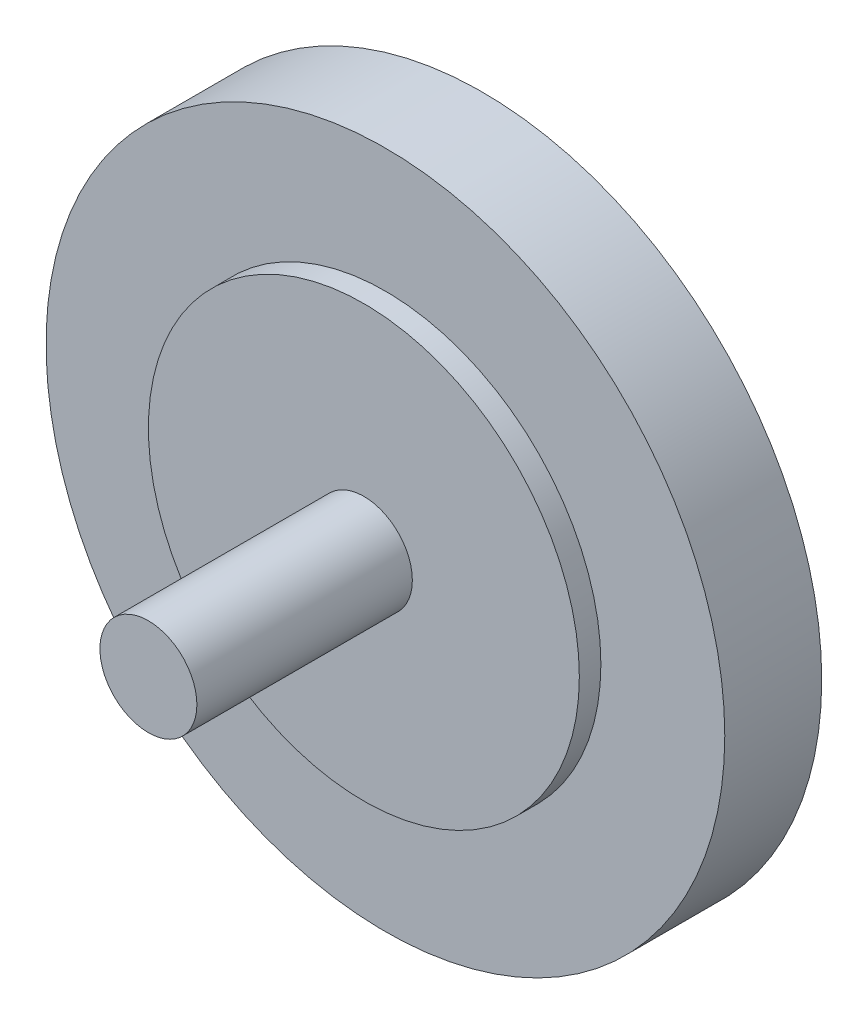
ISO-10303-21;
HEADER;
FILE_DESCRIPTION(('STEP AP214'),'2;1');
FILE_NAME('part.step','',(''),(''),'','','');
FILE_SCHEMA(('AUTOMOTIVE_DESIGN { 1 0 10303 214 1 1 1 1 }'));
ENDSEC;
DATA;
#1=APPLICATION_CONTEXT('core data for automotive mechanical design processes');
#2=APPLICATION_PROTOCOL_DEFINITION('international standard','automotive_design',2000,#1);
#3=PRODUCT_CONTEXT('',#1,'mechanical');
#4=PRODUCT('Part','Part','',(#3));
#5=PRODUCT_RELATED_PRODUCT_CATEGORY('part','',(#4));
#6=PRODUCT_DEFINITION_FORMATION('','',#4);
#7=PRODUCT_DEFINITION_CONTEXT('part definition',#1,'design');
#8=PRODUCT_DEFINITION('design','',#6,#7);
#9=PRODUCT_DEFINITION_SHAPE('','',#8);
#10=(LENGTH_UNIT() NAMED_UNIT(*) SI_UNIT(.MILLI.,.METRE.));
#11=(NAMED_UNIT(*) PLANE_ANGLE_UNIT() SI_UNIT($,.RADIAN.));
#12=(NAMED_UNIT(*) SI_UNIT($,.STERADIAN.) SOLID_ANGLE_UNIT());
#13=UNCERTAINTY_MEASURE_WITH_UNIT(LENGTH_MEASURE(1.E-05),#10,'distance_accuracy_value','');
#14=(GEOMETRIC_REPRESENTATION_CONTEXT(3) GLOBAL_UNCERTAINTY_ASSIGNED_CONTEXT((#13)) GLOBAL_UNIT_ASSIGNED_CONTEXT((#10,
#11,#12)) REPRESENTATION_CONTEXT('',''));
#15=CARTESIAN_POINT('',(0.,0.,0.));
#16=DIRECTION('',(0.,0.,1.));
#17=DIRECTION('',(1.,0.,0.));
#18=AXIS2_PLACEMENT_3D('',#15,#16,#17);
#19=CARTESIAN_POINT('',(0.,0.,11.));
#20=DIRECTION('',(0.,0.,1.));
#21=DIRECTION('',(1.,0.,0.));
#22=AXIS2_PLACEMENT_3D('',#19,#20,#21);
#23=PLANE('',#22);
#24=CARTESIAN_POINT('',(0.,0.,11.));
#25=DIRECTION('',(0.,0.,1.));
#26=DIRECTION('',(1.,0.,0.));
#27=AXIS2_PLACEMENT_3D('',#24,#25,#26);
#28=CIRCLE('',#27,20.);
#29=CARTESIAN_POINT('',(20.,0.,11.));
#30=VERTEX_POINT('',#29);
#31=EDGE_CURVE('E41',#30,#30,#28,.T.);
#32=ORIENTED_EDGE('',*,*,#31,.T.);
#33=EDGE_LOOP('',(#32));
#34=FACE_BOUND('',#33,.T.);
#35=CARTESIAN_POINT('',(0.,0.,11.));
#36=DIRECTION('',(0.,0.,1.));
#37=DIRECTION('',(1.,0.,0.));
#38=AXIS2_PLACEMENT_3D('',#35,#36,#37);
#39=CIRCLE('',#38,4.5);
#40=CARTESIAN_POINT('',(4.5,0.,11.));
#41=VERTEX_POINT('',#40);
#42=EDGE_CURVE('E49',#41,#41,#39,.T.);
#43=ORIENTED_EDGE('',*,*,#42,.F.);
#44=EDGE_LOOP('',(#43));
#45=FACE_BOUND('',#44,.T.);
#46=ADVANCED_FACE('F30',(#34,#45),#23,.T.);
#47=CARTESIAN_POINT('',(0.,0.,9.));
#48=DIRECTION('',(0.,0.,1.));
#49=DIRECTION('',(1.,0.,0.));
#50=AXIS2_PLACEMENT_3D('',#47,#48,#49);
#51=PLANE('',#50);
#52=CARTESIAN_POINT('',(0.,0.,9.));
#53=DIRECTION('',(0.,0.,1.));
#54=DIRECTION('',(1.,0.,0.));
#55=AXIS2_PLACEMENT_3D('',#52,#53,#54);
#56=CIRCLE('',#55,31.5);
#57=CARTESIAN_POINT('',(31.5,0.,9.));
#58=VERTEX_POINT('',#57);
#59=EDGE_CURVE('E10',#58,#58,#56,.T.);
#60=ORIENTED_EDGE('',*,*,#59,.T.);
#61=EDGE_LOOP('',(#60));
#62=FACE_BOUND('',#61,.T.);
#63=CARTESIAN_POINT('',(0.,0.,9.));
#64=DIRECTION('',(0.,0.,1.));
#65=DIRECTION('',(1.,0.,0.));
#66=AXIS2_PLACEMENT_3D('',#63,#64,#65);
#67=CIRCLE('',#66,20.);
#68=CARTESIAN_POINT('',(20.,0.,9.));
#69=VERTEX_POINT('',#68);
#70=EDGE_CURVE('E43',#69,#69,#67,.T.);
#71=ORIENTED_EDGE('',*,*,#70,.F.);
#72=EDGE_LOOP('',(#71));
#73=FACE_BOUND('',#72,.T.);
#74=ADVANCED_FACE('F65',(#62,#73),#51,.T.);
#75=CARTESIAN_POINT('',(0.,0.,9.));
#76=DIRECTION('',(0.,0.,-1.));
#77=DIRECTION('',(-1.,0.,0.));
#78=AXIS2_PLACEMENT_3D('',#75,#76,#77);
#79=CYLINDRICAL_SURFACE('',#78,31.5);
#80=ORIENTED_EDGE('',*,*,#59,.F.);
#81=EDGE_LOOP('',(#80));
#82=FACE_BOUND('',#81,.T.);
#83=CARTESIAN_POINT('',(0.,0.,0.));
#84=DIRECTION('',(0.,0.,1.));
#85=DIRECTION('',(1.,0.,0.));
#86=AXIS2_PLACEMENT_3D('',#83,#84,#85);
#87=CIRCLE('',#86,31.5);
#88=CARTESIAN_POINT('',(31.5,0.,0.));
#89=VERTEX_POINT('',#88);
#90=EDGE_CURVE('E34',#89,#89,#87,.T.);
#91=ORIENTED_EDGE('',*,*,#90,.T.);
#92=EDGE_LOOP('',(#91));
#93=FACE_BOUND('',#92,.T.);
#94=ADVANCED_FACE('F32',(#82,#93),#79,.T.);
#95=CARTESIAN_POINT('',(0.,0.,0.));
#96=DIRECTION('',(0.,0.,1.));
#97=DIRECTION('',(1.,0.,0.));
#98=AXIS2_PLACEMENT_3D('',#95,#96,#97);
#99=PLANE('',#98);
#100=ORIENTED_EDGE('',*,*,#90,.F.);
#101=EDGE_LOOP('',(#100));
#102=FACE_BOUND('',#101,.T.);
#103=ADVANCED_FACE('F75',(#102),#99,.F.);
#104=CARTESIAN_POINT('',(0.,0.,11.));
#105=DIRECTION('',(0.,0.,-1.));
#106=DIRECTION('',(-1.,0.,0.));
#107=AXIS2_PLACEMENT_3D('',#104,#105,#106);
#108=CYLINDRICAL_SURFACE('',#107,20.);
#109=ORIENTED_EDGE('',*,*,#31,.F.);
#110=EDGE_LOOP('',(#109));
#111=FACE_BOUND('',#110,.T.);
#112=ORIENTED_EDGE('',*,*,#70,.T.);
#113=EDGE_LOOP('',(#112));
#114=FACE_BOUND('',#113,.T.);
#115=ADVANCED_FACE('F60',(#111,#114),#108,.T.);
#116=CARTESIAN_POINT('',(0.,0.,31.));
#117=DIRECTION('',(0.,0.,-1.));
#118=DIRECTION('',(-1.,0.,0.));
#119=AXIS2_PLACEMENT_3D('',#116,#117,#118);
#120=CYLINDRICAL_SURFACE('',#119,4.5);
#121=CARTESIAN_POINT('',(0.,0.,31.));
#122=DIRECTION('',(0.,0.,1.));
#123=DIRECTION('',(1.,0.,0.));
#124=AXIS2_PLACEMENT_3D('',#121,#122,#123);
#125=CIRCLE('',#124,4.5);
#126=CARTESIAN_POINT('',(4.5,0.,31.));
#127=VERTEX_POINT('',#126);
#128=EDGE_CURVE('E46',#127,#127,#125,.T.);
#129=ORIENTED_EDGE('',*,*,#128,.F.);
#130=EDGE_LOOP('',(#129));
#131=FACE_BOUND('',#130,.T.);
#132=ORIENTED_EDGE('',*,*,#42,.T.);
#133=EDGE_LOOP('',(#132));
#134=FACE_BOUND('',#133,.T.);
#135=ADVANCED_FACE('F57',(#131,#134),#120,.T.);
#136=CARTESIAN_POINT('',(0.,0.,31.));
#137=DIRECTION('',(0.,0.,1.));
#138=DIRECTION('',(1.,0.,0.));
#139=AXIS2_PLACEMENT_3D('',#136,#137,#138);
#140=PLANE('',#139);
#141=ORIENTED_EDGE('',*,*,#128,.T.);
#142=EDGE_LOOP('',(#141));
#143=FACE_BOUND('',#142,.T.);
#144=ADVANCED_FACE('F55',(#143),#140,.T.);
#145=CLOSED_SHELL('',(#46,#74,#94,#103,#115,#135,#144));
#146=MANIFOLD_SOLID_BREP('B2',#145);
#147=ADVANCED_BREP_SHAPE_REPRESENTATION('',(#18,#146),#14);
#148=SHAPE_DEFINITION_REPRESENTATION(#9,#147);
ENDSEC;
END-ISO-10303-21;
